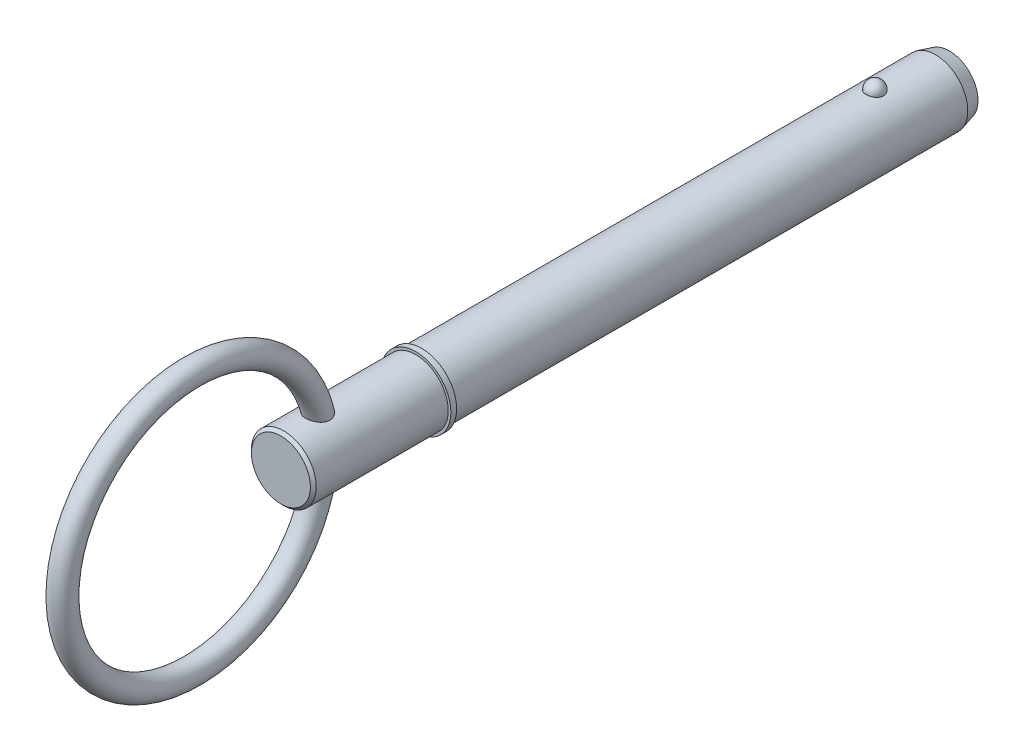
from build123d import *

# Parameters (mm, degrees)
SKETCH2_R           = 5.555
BOSS_EXTRUDE1_DEPTH = 76.2
BOSS_EXTRUDE2_START = 14.27
SKETCH3_R           = 5.555
BOSS_EXTRUDE2_DEPTH = 14.27
CHAMFER1_SIZE       = 2.4
CHAMFER1_SIZE2      = 0.643078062
SKETCH20_W          = 1
SKETCH20_H          = 6
SKETCH21_R          = 5.555
BOSS_EXTRUDE3_DEPTH = 24.13
CHAMFER2_SIZE       = 0.5
SKETCH24_R          = 2


with BuildPart() as part:
    # Sketch2 → Boss-Extrude1 (new body)
    with BuildSketch(Plane.XY):
        with Locations(Location((0, 0, 0), (0, 0, 180))):
            Circle(SKETCH2_R)
    extrude(amount=BOSS_EXTRUDE1_DEPTH)

    # Sketch3 → Boss-Extrude2 (add)
    with BuildSketch(Plane(origin=(0, 0, 0), x_dir=(-1, 0, 0), z_dir=(0, 0, -1)).offset(BOSS_EXTRUDE2_START)):
        Circle(SKETCH3_R)
    extrude(amount=-BOSS_EXTRUDE2_DEPTH)

    # Chamfer1
    chamfer1_edges = [part.edges().sort_by_distance(p)[0] for p in [
        (5.555, 0, -14.27),
    ]]
    chamfer1_side = [part.faces().sort_by_distance(p)[0] for p in [
        (5.555, 0, 30.965),
    ]]
    chamfer(chamfer1_edges, length=CHAMFER1_SIZE, length2=CHAMFER1_SIZE2, reference=chamfer1_side[0])

    # Sketch18 → Revolve1 (revolve)
    with BuildSketch(Plane(origin=(0, 0, 0), x_dir=(0, 0, -1), z_dir=(1, 0, 0))):
        with BuildLine():
            Line((1.49, 7.045), (1.49, 4.065))
            ThreePointArc((1.49, 4.065), (0, 5.555), (1.49, 7.045))
        make_face()
    revolve(axis=Axis((0, 7.045, -1.49), (0, -1, 0)))

    # Sketch20 → Revolve2 (revolve)
    with BuildSketch(Plane(origin=(0, 0, 0), x_dir=(0, 0, -1), z_dir=(1, 0, 0)), mode=Mode.PRIVATE) as revolve2_sk:
        with Locations((-76.7, 3)):
            Rectangle(SKETCH20_W, SKETCH20_H)
    revolve(revolve2_sk.sketch.rotate(Axis((0, 0, 33.728787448), (0, 0, 1)), 90), axis=Axis((0, 0, 33.728787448), (0, 0, 1)))

    # Sketch21 → Boss-Extrude3 (add)
    with BuildSketch(Plane(origin=(0, 0, 76.2), x_dir=(-1, 0, 0), z_dir=(0, 0, -1))):
        Circle(SKETCH21_R)
    extrude(amount=-BOSS_EXTRUDE3_DEPTH)

    # Chamfer2
    chamfer2_edges = [part.edges().sort_by_distance(p)[0] for p in [
        (5.555, 0, 100.33),
    ]]
    chamfer(chamfer2_edges, length=CHAMFER2_SIZE)

    # Sweep1: sweep along a path in Sketch23
    with BuildLine(Plane(origin=(0, 0, 0), x_dir=(0, 0, -1), z_dir=(1, 0, 0))) as sweep1_path:
        CenterArc((-115.555, 0), 22.225, 0, 360)
    # Sketch24 → Sweep1 (sweep)
    with BuildSketch(Plane(origin=(0, 0, 0), x_dir=(1, 0, 0), z_dir=(0, 1, 0))):
        with Locations((0, -93.33)):
            Circle(SKETCH24_R)
    sweep(path=sweep1_path.line)


solid = part.part
